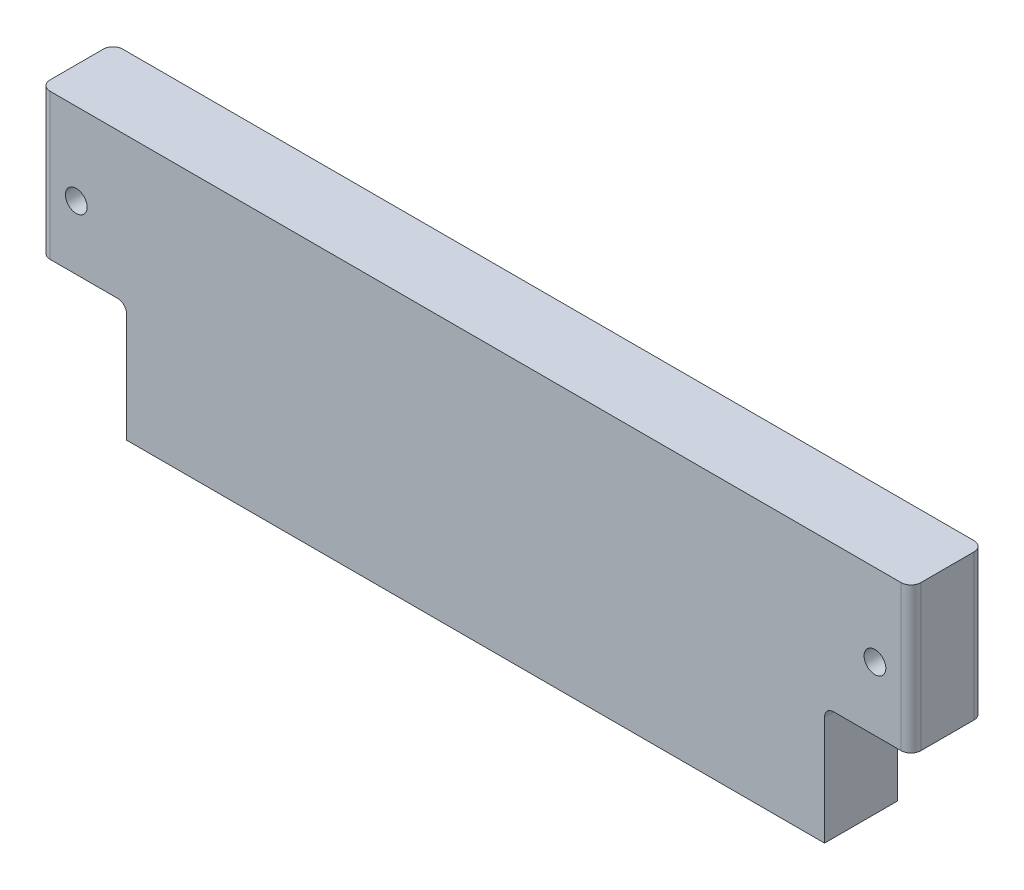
ISO-10303-21;
HEADER;
FILE_DESCRIPTION(('STEP AP214'),'2;1');
FILE_NAME('part.step','',(''),(''),'','','');
FILE_SCHEMA(('AUTOMOTIVE_DESIGN { 1 0 10303 214 1 1 1 1 }'));
ENDSEC;
DATA;
#1=APPLICATION_CONTEXT('core data for automotive mechanical design processes');
#2=APPLICATION_PROTOCOL_DEFINITION('international standard','automotive_design',2000,#1);
#3=PRODUCT_CONTEXT('',#1,'mechanical');
#4=PRODUCT('Part','Part','',(#3));
#5=PRODUCT_RELATED_PRODUCT_CATEGORY('part','',(#4));
#6=PRODUCT_DEFINITION_FORMATION('','',#4);
#7=PRODUCT_DEFINITION_CONTEXT('part definition',#1,'design');
#8=PRODUCT_DEFINITION('design','',#6,#7);
#9=PRODUCT_DEFINITION_SHAPE('','',#8);
#10=(LENGTH_UNIT() NAMED_UNIT(*) SI_UNIT(.MILLI.,.METRE.));
#11=(NAMED_UNIT(*) PLANE_ANGLE_UNIT() SI_UNIT($,.RADIAN.));
#12=(NAMED_UNIT(*) SI_UNIT($,.STERADIAN.) SOLID_ANGLE_UNIT());
#13=UNCERTAINTY_MEASURE_WITH_UNIT(LENGTH_MEASURE(1.E-05),#10,'distance_accuracy_value','');
#14=(GEOMETRIC_REPRESENTATION_CONTEXT(3) GLOBAL_UNCERTAINTY_ASSIGNED_CONTEXT((#13)) GLOBAL_UNIT_ASSIGNED_CONTEXT((#10,
#11,#12)) REPRESENTATION_CONTEXT('',''));
#15=CARTESIAN_POINT('',(0.,0.,0.));
#16=DIRECTION('',(0.,0.,1.));
#17=DIRECTION('',(1.,0.,0.));
#18=AXIS2_PLACEMENT_3D('',#15,#16,#17);
#19=CARTESIAN_POINT('',(-75.946,-12.7,6.35));
#20=DIRECTION('',(0.,1.,0.));
#21=DIRECTION('',(0.,0.,1.));
#22=AXIS2_PLACEMENT_3D('',#19,#20,#21);
#23=PLANE('',#22);
#24=DIRECTION('',(1.,0.,0.));
#25=VECTOR('',#24,1.);
#26=CARTESIAN_POINT('',(-75.946,-12.7,6.35));
#27=LINE('',#26,#25);
#28=CARTESIAN_POINT('',(62.4586000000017,-12.7,6.35));
#29=VERTEX_POINT('',#28);
#30=CARTESIAN_POINT('',(74.2315,-12.7,6.35));
#31=VERTEX_POINT('',#30);
#32=EDGE_CURVE('E183',#29,#31,#27,.T.);
#33=ORIENTED_EDGE('',*,*,#32,.F.);
#34=DIRECTION('',(0.,0.,1.));
#35=VECTOR('',#34,1.);
#36=CARTESIAN_POINT('',(62.4586000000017,-12.7,6.35));
#37=LINE('',#36,#35);
#38=CARTESIAN_POINT('',(62.4586000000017,-12.7,-6.35));
#39=VERTEX_POINT('',#38);
#40=EDGE_CURVE('E58',#29,#39,#37,.F.);
#41=ORIENTED_EDGE('',*,*,#40,.T.);
#42=DIRECTION('',(1.,0.,0.));
#43=VECTOR('',#42,1.);
#44=CARTESIAN_POINT('',(-75.946,-12.7,-6.35));
#45=LINE('',#44,#43);
#46=CARTESIAN_POINT('',(74.2315,-12.7,-6.35));
#47=VERTEX_POINT('',#46);
#48=EDGE_CURVE('E190',#39,#47,#45,.T.);
#49=ORIENTED_EDGE('',*,*,#48,.T.);
#50=CARTESIAN_POINT('',(74.2315,-12.7,-4.6355));
#51=DIRECTION('',(0.,1.,0.));
#52=DIRECTION('',(0.,0.,1.));
#53=AXIS2_PLACEMENT_3D('',#50,#51,#52);
#54=CIRCLE('',#53,1.7145);
#55=CARTESIAN_POINT('',(75.946,-12.7,-4.6355));
#56=VERTEX_POINT('',#55);
#57=EDGE_CURVE('E240',#47,#56,#54,.F.);
#58=ORIENTED_EDGE('',*,*,#57,.T.);
#59=DIRECTION('',(0.,0.,-1.));
#60=VECTOR('',#59,1.);
#61=CARTESIAN_POINT('',(75.946,-12.7,6.35));
#62=LINE('',#61,#60);
#63=CARTESIAN_POINT('',(75.946,-12.7,4.6355));
#64=VERTEX_POINT('',#63);
#65=EDGE_CURVE('E187',#64,#56,#62,.T.);
#66=ORIENTED_EDGE('',*,*,#65,.F.);
#67=CARTESIAN_POINT('',(74.2315,-12.7,4.6355));
#68=DIRECTION('',(0.,1.,0.));
#69=DIRECTION('',(0.,0.,1.));
#70=AXIS2_PLACEMENT_3D('',#67,#68,#69);
#71=CIRCLE('',#70,1.7145);
#72=EDGE_CURVE('E237',#64,#31,#71,.F.);
#73=ORIENTED_EDGE('',*,*,#72,.T.);
#74=EDGE_LOOP('',(#33,#41,#49,#58,#66,#73));
#75=FACE_BOUND('',#74,.T.);
#76=ADVANCED_FACE('F37',(#75),#23,.F.);
#77=CARTESIAN_POINT('',(75.946,12.7,6.35));
#78=DIRECTION('',(-1.,0.,0.));
#79=DIRECTION('',(0.,0.,1.));
#80=AXIS2_PLACEMENT_3D('',#77,#78,#79);
#81=PLANE('',#80);
#82=ORIENTED_EDGE('',*,*,#65,.T.);
#83=DIRECTION('',(0.,1.,0.));
#84=VECTOR('',#83,1.);
#85=CARTESIAN_POINT('',(75.946,12.7,-4.6355));
#86=LINE('',#85,#84);
#87=CARTESIAN_POINT('',(75.946,12.7,-4.6355));
#88=VERTEX_POINT('',#87);
#89=EDGE_CURVE('E234',#56,#88,#86,.T.);
#90=ORIENTED_EDGE('',*,*,#89,.T.);
#91=DIRECTION('',(0.,0.,-1.));
#92=VECTOR('',#91,1.);
#93=CARTESIAN_POINT('',(75.946,12.7,6.35));
#94=LINE('',#93,#92);
#95=CARTESIAN_POINT('',(75.946,12.7,4.6355));
#96=VERTEX_POINT('',#95);
#97=EDGE_CURVE('E201',#96,#88,#94,.T.);
#98=ORIENTED_EDGE('',*,*,#97,.F.);
#99=DIRECTION('',(0.,1.,0.));
#100=VECTOR('',#99,1.);
#101=CARTESIAN_POINT('',(75.946,-12.7,4.6355));
#102=LINE('',#101,#100);
#103=EDGE_CURVE('E232',#96,#64,#102,.F.);
#104=ORIENTED_EDGE('',*,*,#103,.T.);
#105=EDGE_LOOP('',(#82,#90,#98,#104));
#106=FACE_BOUND('',#105,.T.);
#107=ADVANCED_FACE('F275',(#106),#81,.F.);
#108=CARTESIAN_POINT('',(-75.946,12.7,6.35));
#109=DIRECTION('',(0.,-1.,0.));
#110=DIRECTION('',(0.,0.,-1.));
#111=AXIS2_PLACEMENT_3D('',#108,#109,#110);
#112=PLANE('',#111);
#113=DIRECTION('',(-1.,0.,0.));
#114=VECTOR('',#113,1.);
#115=CARTESIAN_POINT('',(-75.946,12.7,-6.35));
#116=LINE('',#115,#114);
#117=CARTESIAN_POINT('',(74.2315,12.7,-6.35));
#118=VERTEX_POINT('',#117);
#119=CARTESIAN_POINT('',(-74.2315,12.7,-6.35));
#120=VERTEX_POINT('',#119);
#121=EDGE_CURVE('E180',#118,#120,#116,.T.);
#122=ORIENTED_EDGE('',*,*,#121,.T.);
#123=CARTESIAN_POINT('',(-74.2315,12.7,-4.6355));
#124=DIRECTION('',(0.,-1.,0.));
#125=DIRECTION('',(0.,0.,-1.));
#126=AXIS2_PLACEMENT_3D('',#123,#124,#125);
#127=CIRCLE('',#126,1.7145);
#128=CARTESIAN_POINT('',(-75.946,12.7,-4.6355));
#129=VERTEX_POINT('',#128);
#130=EDGE_CURVE('E224',#120,#129,#127,.F.);
#131=ORIENTED_EDGE('',*,*,#130,.T.);
#132=DIRECTION('',(0.,0.,-1.));
#133=VECTOR('',#132,1.);
#134=CARTESIAN_POINT('',(-75.946,12.7,6.35));
#135=LINE('',#134,#133);
#136=CARTESIAN_POINT('',(-75.946,12.7,4.6355));
#137=VERTEX_POINT('',#136);
#138=EDGE_CURVE('E198',#137,#129,#135,.T.);
#139=ORIENTED_EDGE('',*,*,#138,.F.);
#140=CARTESIAN_POINT('',(-74.2315,12.7,4.6355));
#141=DIRECTION('',(0.,-1.,0.));
#142=DIRECTION('',(0.,0.,-1.));
#143=AXIS2_PLACEMENT_3D('',#140,#141,#142);
#144=CIRCLE('',#143,1.7145);
#145=CARTESIAN_POINT('',(-74.2315,12.7,6.35));
#146=VERTEX_POINT('',#145);
#147=EDGE_CURVE('E222',#137,#146,#144,.F.);
#148=ORIENTED_EDGE('',*,*,#147,.T.);
#149=DIRECTION('',(-1.,0.,0.));
#150=VECTOR('',#149,1.);
#151=CARTESIAN_POINT('',(-75.946,12.7,6.35));
#152=LINE('',#151,#150);
#153=CARTESIAN_POINT('',(74.2315,12.7,6.35));
#154=VERTEX_POINT('',#153);
#155=EDGE_CURVE('E181',#154,#146,#152,.T.);
#156=ORIENTED_EDGE('',*,*,#155,.F.);
#157=CARTESIAN_POINT('',(74.2315,12.7,4.6355));
#158=DIRECTION('',(0.,-1.,0.));
#159=DIRECTION('',(0.,0.,-1.));
#160=AXIS2_PLACEMENT_3D('',#157,#158,#159);
#161=CIRCLE('',#160,1.7145);
#162=EDGE_CURVE('E218',#154,#96,#161,.F.);
#163=ORIENTED_EDGE('',*,*,#162,.T.);
#164=ORIENTED_EDGE('',*,*,#97,.T.);
#165=CARTESIAN_POINT('',(74.2315,12.7,-4.6355));
#166=DIRECTION('',(0.,-1.,0.));
#167=DIRECTION('',(0.,0.,-1.));
#168=AXIS2_PLACEMENT_3D('',#165,#166,#167);
#169=CIRCLE('',#168,1.7145);
#170=EDGE_CURVE('E220',#88,#118,#169,.F.);
#171=ORIENTED_EDGE('',*,*,#170,.T.);
#172=EDGE_LOOP('',(#122,#131,#139,#148,#156,#163,#164,#171));
#173=FACE_BOUND('',#172,.T.);
#174=ADVANCED_FACE('F280',(#173),#112,.F.);
#175=CARTESIAN_POINT('',(-75.946,12.7,6.35));
#176=DIRECTION('',(1.,0.,0.));
#177=DIRECTION('',(0.,0.,-1.));
#178=AXIS2_PLACEMENT_3D('',#175,#176,#177);
#179=PLANE('',#178);
#180=ORIENTED_EDGE('',*,*,#138,.T.);
#181=DIRECTION('',(0.,-1.,0.));
#182=VECTOR('',#181,1.);
#183=CARTESIAN_POINT('',(-75.946,12.7,-4.6355));
#184=LINE('',#183,#182);
#185=CARTESIAN_POINT('',(-75.946,-12.7,-4.6355));
#186=VERTEX_POINT('',#185);
#187=EDGE_CURVE('E206',#129,#186,#184,.T.);
#188=ORIENTED_EDGE('',*,*,#187,.T.);
#189=DIRECTION('',(0.,0.,-1.));
#190=VECTOR('',#189,1.);
#191=CARTESIAN_POINT('',(-75.946,-12.7,6.35));
#192=LINE('',#191,#190);
#193=CARTESIAN_POINT('',(-75.946,-12.7,4.6355));
#194=VERTEX_POINT('',#193);
#195=EDGE_CURVE('E195',#194,#186,#192,.T.);
#196=ORIENTED_EDGE('',*,*,#195,.F.);
#197=DIRECTION('',(0.,-1.,0.));
#198=VECTOR('',#197,1.);
#199=CARTESIAN_POINT('',(-75.946,12.7,4.6355));
#200=LINE('',#199,#198);
#201=EDGE_CURVE('E204',#194,#137,#200,.F.);
#202=ORIENTED_EDGE('',*,*,#201,.T.);
#203=EDGE_LOOP('',(#180,#188,#196,#202));
#204=FACE_BOUND('',#203,.T.);
#205=ADVANCED_FACE('F286',(#204),#179,.F.);
#206=CARTESIAN_POINT('',(-74.2315,-12.7,-6.35));
#207=VERTEX_POINT('',#206);
#208=CARTESIAN_POINT('',(-62.4586000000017,-12.7,-6.35));
#209=VERTEX_POINT('',#208);
#210=EDGE_CURVE('E184',#207,#209,#45,.T.);
#211=ORIENTED_EDGE('',*,*,#210,.T.);
#212=DIRECTION('',(0.,0.,1.));
#213=VECTOR('',#212,1.);
#214=CARTESIAN_POINT('',(-62.4586000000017,-12.7,6.35));
#215=LINE('',#214,#213);
#216=CARTESIAN_POINT('',(-62.4586000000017,-12.7,6.35));
#217=VERTEX_POINT('',#216);
#218=EDGE_CURVE('E242',#209,#217,#215,.T.);
#219=ORIENTED_EDGE('',*,*,#218,.T.);
#220=CARTESIAN_POINT('',(-74.2315,-12.7,6.35));
#221=VERTEX_POINT('',#220);
#222=EDGE_CURVE('E185',#221,#217,#27,.T.);
#223=ORIENTED_EDGE('',*,*,#222,.F.);
#224=CARTESIAN_POINT('',(-74.2315,-12.7,4.6355));
#225=DIRECTION('',(0.,1.,0.));
#226=DIRECTION('',(0.,0.,1.));
#227=AXIS2_PLACEMENT_3D('',#224,#225,#226);
#228=CIRCLE('',#227,1.7145);
#229=EDGE_CURVE('E209',#221,#194,#228,.F.);
#230=ORIENTED_EDGE('',*,*,#229,.T.);
#231=ORIENTED_EDGE('',*,*,#195,.T.);
#232=CARTESIAN_POINT('',(-74.2315,-12.7,-4.6355));
#233=DIRECTION('',(0.,1.,0.));
#234=DIRECTION('',(0.,0.,1.));
#235=AXIS2_PLACEMENT_3D('',#232,#233,#234);
#236=CIRCLE('',#235,1.7145);
#237=EDGE_CURVE('E211',#186,#207,#236,.F.);
#238=ORIENTED_EDGE('',*,*,#237,.T.);
#239=EDGE_LOOP('',(#211,#219,#223,#230,#231,#238));
#240=FACE_BOUND('',#239,.T.);
#241=ADVANCED_FACE('F261',(#240),#23,.F.);
#242=CARTESIAN_POINT('',(0.,0.,6.35));
#243=DIRECTION('',(0.,0.,1.));
#244=DIRECTION('',(1.,0.,0.));
#245=AXIS2_PLACEMENT_3D('',#242,#243,#244);
#246=PLANE('',#245);
#247=CARTESIAN_POINT('',(-69.6595,-1.5875,6.35));
#248=DIRECTION('',(0.,0.,1.));
#249=DIRECTION('',(1.,0.,0.));
#250=AXIS2_PLACEMENT_3D('',#247,#248,#249);
#251=CIRCLE('',#250,1.89865);
#252=CARTESIAN_POINT('',(-67.76085,-1.5875,6.35));
#253=VERTEX_POINT('',#252);
#254=EDGE_CURVE('E168',#253,#253,#251,.T.);
#255=ORIENTED_EDGE('',*,*,#254,.F.);
#256=EDGE_LOOP('',(#255));
#257=FACE_BOUND('',#256,.T.);
#258=CARTESIAN_POINT('',(69.6595,-1.58749999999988,6.35));
#259=DIRECTION('',(0.,0.,1.));
#260=DIRECTION('',(1.,0.,0.));
#261=AXIS2_PLACEMENT_3D('',#258,#259,#260);
#262=CIRCLE('',#261,1.89865);
#263=CARTESIAN_POINT('',(71.55815,-1.58749999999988,6.35));
#264=VERTEX_POINT('',#263);
#265=EDGE_CURVE('E174',#264,#264,#262,.T.);
#266=ORIENTED_EDGE('',*,*,#265,.F.);
#267=EDGE_LOOP('',(#266));
#268=FACE_BOUND('',#267,.T.);
#269=ORIENTED_EDGE('',*,*,#155,.T.);
#270=DIRECTION('',(0.,-1.,0.));
#271=VECTOR('',#270,1.);
#272=CARTESIAN_POINT('',(-74.2315,-12.7,6.35));
#273=LINE('',#272,#271);
#274=EDGE_CURVE('E229',#146,#221,#273,.T.);
#275=ORIENTED_EDGE('',*,*,#274,.T.);
#276=ORIENTED_EDGE('',*,*,#222,.T.);
#277=CARTESIAN_POINT('',(-62.4586000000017,-14.2875,6.35));
#278=DIRECTION('',(0.,0.,1.));
#279=DIRECTION('',(1.,0.,0.));
#280=AXIS2_PLACEMENT_3D('',#277,#278,#279);
#281=CIRCLE('',#280,1.5875);
#282=CARTESIAN_POINT('',(-60.8711000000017,-14.2875,6.35));
#283=VERTEX_POINT('',#282);
#284=EDGE_CURVE('E142',#217,#283,#281,.F.);
#285=ORIENTED_EDGE('',*,*,#284,.T.);
#286=DIRECTION('',(0.,-1.,0.));
#287=VECTOR('',#286,1.);
#288=CARTESIAN_POINT('',(-60.8711000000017,-12.7,6.35));
#289=LINE('',#288,#287);
#290=CARTESIAN_POINT('',(-60.8711000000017,-33.3375,6.35));
#291=VERTEX_POINT('',#290);
#292=EDGE_CURVE('E135',#283,#291,#289,.T.);
#293=ORIENTED_EDGE('',*,*,#292,.T.);
#294=DIRECTION('',(1.,0.,0.));
#295=VECTOR('',#294,1.);
#296=CARTESIAN_POINT('',(-60.8711000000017,-33.3375,6.35));
#297=LINE('',#296,#295);
#298=CARTESIAN_POINT('',(60.8711000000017,-33.3375,6.35));
#299=VERTEX_POINT('',#298);
#300=EDGE_CURVE('E140',#291,#299,#297,.T.);
#301=ORIENTED_EDGE('',*,*,#300,.T.);
#302=DIRECTION('',(0.,1.,0.));
#303=VECTOR('',#302,1.);
#304=CARTESIAN_POINT('',(60.8711000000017,-12.7,6.35));
#305=LINE('',#304,#303);
#306=CARTESIAN_POINT('',(60.8711000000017,-14.2875,6.35));
#307=VERTEX_POINT('',#306);
#308=EDGE_CURVE('E155',#299,#307,#305,.T.);
#309=ORIENTED_EDGE('',*,*,#308,.T.);
#310=CARTESIAN_POINT('',(62.4586000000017,-14.2875,6.34999999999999));
#311=DIRECTION('',(0.,0.,1.));
#312=DIRECTION('',(1.,0.,0.));
#313=AXIS2_PLACEMENT_3D('',#310,#311,#312);
#314=CIRCLE('',#313,1.5875);
#315=EDGE_CURVE('E45',#307,#29,#314,.F.);
#316=ORIENTED_EDGE('',*,*,#315,.T.);
#317=ORIENTED_EDGE('',*,*,#32,.T.);
#318=DIRECTION('',(0.,1.,0.));
#319=VECTOR('',#318,1.);
#320=CARTESIAN_POINT('',(74.2315,12.7,6.35));
#321=LINE('',#320,#319);
#322=EDGE_CURVE('E226',#31,#154,#321,.T.);
#323=ORIENTED_EDGE('',*,*,#322,.T.);
#324=EDGE_LOOP('',(#269,#275,#276,#285,#293,#301,#309,#316,#317,#323));
#325=FACE_BOUND('',#324,.T.);
#326=ADVANCED_FACE('F138',(#257,#268,#325),#246,.T.);
#327=CARTESIAN_POINT('',(0.,0.,-6.35));
#328=DIRECTION('',(0.,0.,1.));
#329=DIRECTION('',(1.,0.,0.));
#330=AXIS2_PLACEMENT_3D('',#327,#328,#329);
#331=PLANE('',#330);
#332=CARTESIAN_POINT('',(-69.6595,-1.5875,-6.35));
#333=DIRECTION('',(0.,0.,1.));
#334=DIRECTION('',(1.,0.,0.));
#335=AXIS2_PLACEMENT_3D('',#332,#333,#334);
#336=CIRCLE('',#335,1.89865);
#337=CARTESIAN_POINT('',(-67.76085,-1.5875,-6.35));
#338=VERTEX_POINT('',#337);
#339=EDGE_CURVE('E171',#338,#338,#336,.T.);
#340=ORIENTED_EDGE('',*,*,#339,.T.);
#341=EDGE_LOOP('',(#340));
#342=FACE_BOUND('',#341,.T.);
#343=CARTESIAN_POINT('',(69.6595,-1.58749999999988,-6.35));
#344=DIRECTION('',(0.,0.,1.));
#345=DIRECTION('',(1.,0.,0.));
#346=AXIS2_PLACEMENT_3D('',#343,#344,#345);
#347=CIRCLE('',#346,1.89865);
#348=CARTESIAN_POINT('',(71.55815,-1.58749999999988,-6.35));
#349=VERTEX_POINT('',#348);
#350=EDGE_CURVE('E177',#349,#349,#347,.T.);
#351=ORIENTED_EDGE('',*,*,#350,.T.);
#352=EDGE_LOOP('',(#351));
#353=FACE_BOUND('',#352,.T.);
#354=ORIENTED_EDGE('',*,*,#210,.F.);
#355=DIRECTION('',(0.,-1.,0.));
#356=VECTOR('',#355,1.);
#357=CARTESIAN_POINT('',(-74.2315,0.,-6.35));
#358=LINE('',#357,#356);
#359=EDGE_CURVE('E216',#207,#120,#358,.F.);
#360=ORIENTED_EDGE('',*,*,#359,.T.);
#361=ORIENTED_EDGE('',*,*,#121,.F.);
#362=DIRECTION('',(0.,1.,0.));
#363=VECTOR('',#362,1.);
#364=CARTESIAN_POINT('',(74.2315,0.,-6.35));
#365=LINE('',#364,#363);
#366=EDGE_CURVE('E213',#118,#47,#365,.F.);
#367=ORIENTED_EDGE('',*,*,#366,.T.);
#368=ORIENTED_EDGE('',*,*,#48,.F.);
#369=CARTESIAN_POINT('',(62.4586000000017,-14.2875,-6.34999999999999));
#370=DIRECTION('',(0.,0.,1.));
#371=DIRECTION('',(1.,0.,0.));
#372=AXIS2_PLACEMENT_3D('',#369,#370,#371);
#373=CIRCLE('',#372,1.5875);
#374=CARTESIAN_POINT('',(60.8711000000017,-14.2875,-6.34999999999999));
#375=VERTEX_POINT('',#374);
#376=EDGE_CURVE('E11',#39,#375,#373,.T.);
#377=ORIENTED_EDGE('',*,*,#376,.T.);
#378=DIRECTION('',(0.,-1.,0.));
#379=VECTOR('',#378,1.);
#380=CARTESIAN_POINT('',(60.8711000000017,-12.7,-6.34999999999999));
#381=LINE('',#380,#379);
#382=CARTESIAN_POINT('',(60.8711000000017,-33.3375,-6.34999999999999));
#383=VERTEX_POINT('',#382);
#384=EDGE_CURVE('E164',#375,#383,#381,.T.);
#385=ORIENTED_EDGE('',*,*,#384,.T.);
#386=DIRECTION('',(-1.,0.,0.));
#387=VECTOR('',#386,1.);
#388=CARTESIAN_POINT('',(-60.8711000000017,-33.3375,-6.34999999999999));
#389=LINE('',#388,#387);
#390=CARTESIAN_POINT('',(-60.8711000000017,-33.3375,-6.34999999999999));
#391=VERTEX_POINT('',#390);
#392=EDGE_CURVE('E166',#383,#391,#389,.T.);
#393=ORIENTED_EDGE('',*,*,#392,.T.);
#394=DIRECTION('',(0.,1.,0.));
#395=VECTOR('',#394,1.);
#396=CARTESIAN_POINT('',(-60.8711000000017,-12.7,-6.34999999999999));
#397=LINE('',#396,#395);
#398=CARTESIAN_POINT('',(-60.8711000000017,-14.2875,-6.34999999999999));
#399=VERTEX_POINT('',#398);
#400=EDGE_CURVE('E151',#391,#399,#397,.T.);
#401=ORIENTED_EDGE('',*,*,#400,.T.);
#402=CARTESIAN_POINT('',(-62.4586000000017,-14.2875,-6.35));
#403=DIRECTION('',(0.,0.,1.));
#404=DIRECTION('',(1.,0.,0.));
#405=AXIS2_PLACEMENT_3D('',#402,#403,#404);
#406=CIRCLE('',#405,1.5875);
#407=EDGE_CURVE('E252',#399,#209,#406,.T.);
#408=ORIENTED_EDGE('',*,*,#407,.T.);
#409=EDGE_LOOP('',(#354,#360,#361,#367,#368,#377,#385,#393,#401,#408));
#410=FACE_BOUND('',#409,.T.);
#411=ADVANCED_FACE('F256',(#342,#353,#410),#331,.F.);
#412=CARTESIAN_POINT('',(69.6595,-1.58749999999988,6.35));
#413=DIRECTION('',(0.,0.,1.));
#414=DIRECTION('',(1.,0.,0.));
#415=AXIS2_PLACEMENT_3D('',#412,#413,#414);
#416=CYLINDRICAL_SURFACE('',#415,1.89865);
#417=ORIENTED_EDGE('',*,*,#350,.F.);
#418=EDGE_LOOP('',(#417));
#419=FACE_BOUND('',#418,.T.);
#420=ORIENTED_EDGE('',*,*,#265,.T.);
#421=EDGE_LOOP('',(#420));
#422=FACE_BOUND('',#421,.T.);
#423=ADVANCED_FACE('F338',(#419,#422),#416,.F.);
#424=CARTESIAN_POINT('',(-69.6595,-1.5875,6.35));
#425=DIRECTION('',(0.,0.,1.));
#426=DIRECTION('',(1.,0.,0.));
#427=AXIS2_PLACEMENT_3D('',#424,#425,#426);
#428=CYLINDRICAL_SURFACE('',#427,1.89865);
#429=ORIENTED_EDGE('',*,*,#339,.F.);
#430=EDGE_LOOP('',(#429));
#431=FACE_BOUND('',#430,.T.);
#432=ORIENTED_EDGE('',*,*,#254,.T.);
#433=EDGE_LOOP('',(#432));
#434=FACE_BOUND('',#433,.T.);
#435=ADVANCED_FACE('F333',(#431,#434),#428,.F.);
#436=CARTESIAN_POINT('',(-60.8711000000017,-12.7,-129.82902521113));
#437=DIRECTION('',(-1.,0.,0.));
#438=DIRECTION('',(0.,-1.,0.));
#439=AXIS2_PLACEMENT_3D('',#436,#437,#438);
#440=PLANE('',#439);
#441=ORIENTED_EDGE('',*,*,#292,.F.);
#442=DIRECTION('',(0.,0.,1.));
#443=VECTOR('',#442,1.);
#444=CARTESIAN_POINT('',(-60.8711000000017,-14.2875,-129.82902521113));
#445=LINE('',#444,#443);
#446=EDGE_CURVE('E245',#283,#399,#445,.F.);
#447=ORIENTED_EDGE('',*,*,#446,.T.);
#448=ORIENTED_EDGE('',*,*,#400,.F.);
#449=DIRECTION('',(0.,0.,1.));
#450=VECTOR('',#449,1.);
#451=CARTESIAN_POINT('',(-60.8711000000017,-33.3375,-129.82902521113));
#452=LINE('',#451,#450);
#453=EDGE_CURVE('E148',#391,#291,#452,.T.);
#454=ORIENTED_EDGE('',*,*,#453,.T.);
#455=EDGE_LOOP('',(#441,#447,#448,#454));
#456=FACE_BOUND('',#455,.T.);
#457=ADVANCED_FACE('F149',(#456),#440,.T.);
#458=CARTESIAN_POINT('',(60.8711000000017,-12.7,-129.82902521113));
#459=DIRECTION('',(1.,0.,0.));
#460=DIRECTION('',(0.,1.,0.));
#461=AXIS2_PLACEMENT_3D('',#458,#459,#460);
#462=PLANE('',#461);
#463=ORIENTED_EDGE('',*,*,#384,.F.);
#464=DIRECTION('',(0.,0.,1.));
#465=VECTOR('',#464,1.);
#466=CARTESIAN_POINT('',(60.8711000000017,-14.2875,-129.82902521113));
#467=LINE('',#466,#465);
#468=EDGE_CURVE('E247',#375,#307,#467,.T.);
#469=ORIENTED_EDGE('',*,*,#468,.T.);
#470=ORIENTED_EDGE('',*,*,#308,.F.);
#471=DIRECTION('',(0.,0.,1.));
#472=VECTOR('',#471,1.);
#473=CARTESIAN_POINT('',(60.8711000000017,-33.3375,-129.82902521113));
#474=LINE('',#473,#472);
#475=EDGE_CURVE('E154',#383,#299,#474,.T.);
#476=ORIENTED_EDGE('',*,*,#475,.F.);
#477=EDGE_LOOP('',(#463,#469,#470,#476));
#478=FACE_BOUND('',#477,.T.);
#479=ADVANCED_FACE('F324',(#478),#462,.T.);
#480=CARTESIAN_POINT('',(-60.8711000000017,-33.3375,-129.82902521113));
#481=DIRECTION('',(0.,-1.,0.));
#482=DIRECTION('',(0.,0.,-1.));
#483=AXIS2_PLACEMENT_3D('',#480,#481,#482);
#484=PLANE('',#483);
#485=ORIENTED_EDGE('',*,*,#392,.F.);
#486=ORIENTED_EDGE('',*,*,#475,.T.);
#487=ORIENTED_EDGE('',*,*,#300,.F.);
#488=ORIENTED_EDGE('',*,*,#453,.F.);
#489=EDGE_LOOP('',(#485,#486,#487,#488));
#490=FACE_BOUND('',#489,.T.);
#491=ADVANCED_FACE('F157',(#490),#484,.T.);
#492=CARTESIAN_POINT('',(-74.2315,12.7,-4.6355));
#493=DIRECTION('',(0.,-1.,0.));
#494=DIRECTION('',(0.,0.,-1.));
#495=AXIS2_PLACEMENT_3D('',#492,#493,#494);
#496=CYLINDRICAL_SURFACE('',#495,1.7145);
#497=ORIENTED_EDGE('',*,*,#130,.F.);
#498=ORIENTED_EDGE('',*,*,#359,.F.);
#499=ORIENTED_EDGE('',*,*,#237,.F.);
#500=ORIENTED_EDGE('',*,*,#187,.F.);
#501=EDGE_LOOP('',(#497,#498,#499,#500));
#502=FACE_BOUND('',#501,.T.);
#503=ADVANCED_FACE('F300',(#502),#496,.T.);
#504=CARTESIAN_POINT('',(-74.2315,0.,4.6355));
#505=DIRECTION('',(0.,1.,0.));
#506=DIRECTION('',(0.,0.,1.));
#507=AXIS2_PLACEMENT_3D('',#504,#505,#506);
#508=CYLINDRICAL_SURFACE('',#507,1.7145);
#509=ORIENTED_EDGE('',*,*,#147,.F.);
#510=ORIENTED_EDGE('',*,*,#201,.F.);
#511=ORIENTED_EDGE('',*,*,#229,.F.);
#512=ORIENTED_EDGE('',*,*,#274,.F.);
#513=EDGE_LOOP('',(#509,#510,#511,#512));
#514=FACE_BOUND('',#513,.T.);
#515=ADVANCED_FACE('F303',(#514),#508,.T.);
#516=CARTESIAN_POINT('',(74.2315,12.7,-4.6355));
#517=DIRECTION('',(0.,1.,0.));
#518=DIRECTION('',(0.,0.,1.));
#519=AXIS2_PLACEMENT_3D('',#516,#517,#518);
#520=CYLINDRICAL_SURFACE('',#519,1.7145);
#521=ORIENTED_EDGE('',*,*,#57,.F.);
#522=ORIENTED_EDGE('',*,*,#366,.F.);
#523=ORIENTED_EDGE('',*,*,#170,.F.);
#524=ORIENTED_EDGE('',*,*,#89,.F.);
#525=EDGE_LOOP('',(#521,#522,#523,#524));
#526=FACE_BOUND('',#525,.T.);
#527=ADVANCED_FACE('F271',(#526),#520,.T.);
#528=CARTESIAN_POINT('',(74.2315,0.,4.6355));
#529=DIRECTION('',(0.,-1.,0.));
#530=DIRECTION('',(0.,0.,-1.));
#531=AXIS2_PLACEMENT_3D('',#528,#529,#530);
#532=CYLINDRICAL_SURFACE('',#531,1.7145);
#533=ORIENTED_EDGE('',*,*,#72,.F.);
#534=ORIENTED_EDGE('',*,*,#103,.F.);
#535=ORIENTED_EDGE('',*,*,#162,.F.);
#536=ORIENTED_EDGE('',*,*,#322,.F.);
#537=EDGE_LOOP('',(#533,#534,#535,#536));
#538=FACE_BOUND('',#537,.T.);
#539=ADVANCED_FACE('F265',(#538),#532,.T.);
#540=CARTESIAN_POINT('',(-62.4586000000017,-14.2875,6.35));
#541=DIRECTION('',(0.,0.,1.));
#542=DIRECTION('',(1.,0.,0.));
#543=AXIS2_PLACEMENT_3D('',#540,#541,#542);
#544=CYLINDRICAL_SURFACE('',#543,1.5875);
#545=ORIENTED_EDGE('',*,*,#407,.F.);
#546=ORIENTED_EDGE('',*,*,#446,.F.);
#547=ORIENTED_EDGE('',*,*,#284,.F.);
#548=ORIENTED_EDGE('',*,*,#218,.F.);
#549=EDGE_LOOP('',(#545,#546,#547,#548));
#550=FACE_BOUND('',#549,.T.);
#551=ADVANCED_FACE('F263',(#550),#544,.F.);
#552=CARTESIAN_POINT('',(62.4586000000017,-14.2875,-129.82902521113));
#553=DIRECTION('',(0.,0.,1.));
#554=DIRECTION('',(1.,0.,0.));
#555=AXIS2_PLACEMENT_3D('',#552,#553,#554);
#556=CYLINDRICAL_SURFACE('',#555,1.5875);
#557=ORIENTED_EDGE('',*,*,#376,.F.);
#558=ORIENTED_EDGE('',*,*,#40,.F.);
#559=ORIENTED_EDGE('',*,*,#315,.F.);
#560=ORIENTED_EDGE('',*,*,#468,.F.);
#561=EDGE_LOOP('',(#557,#558,#559,#560));
#562=FACE_BOUND('',#561,.T.);
#563=ADVANCED_FACE('F39',(#562),#556,.F.);
#564=CLOSED_SHELL('',(#76,#107,#174,#205,#241,#326,#411,#423,#435,#457,#479,#491,#503,#515,#527,
#539,#551,#563));
#565=MANIFOLD_SOLID_BREP('B2',#564);
#566=ADVANCED_BREP_SHAPE_REPRESENTATION('',(#18,#565),#14);
#567=SHAPE_DEFINITION_REPRESENTATION(#9,#566);
ENDSEC;
END-ISO-10303-21;
